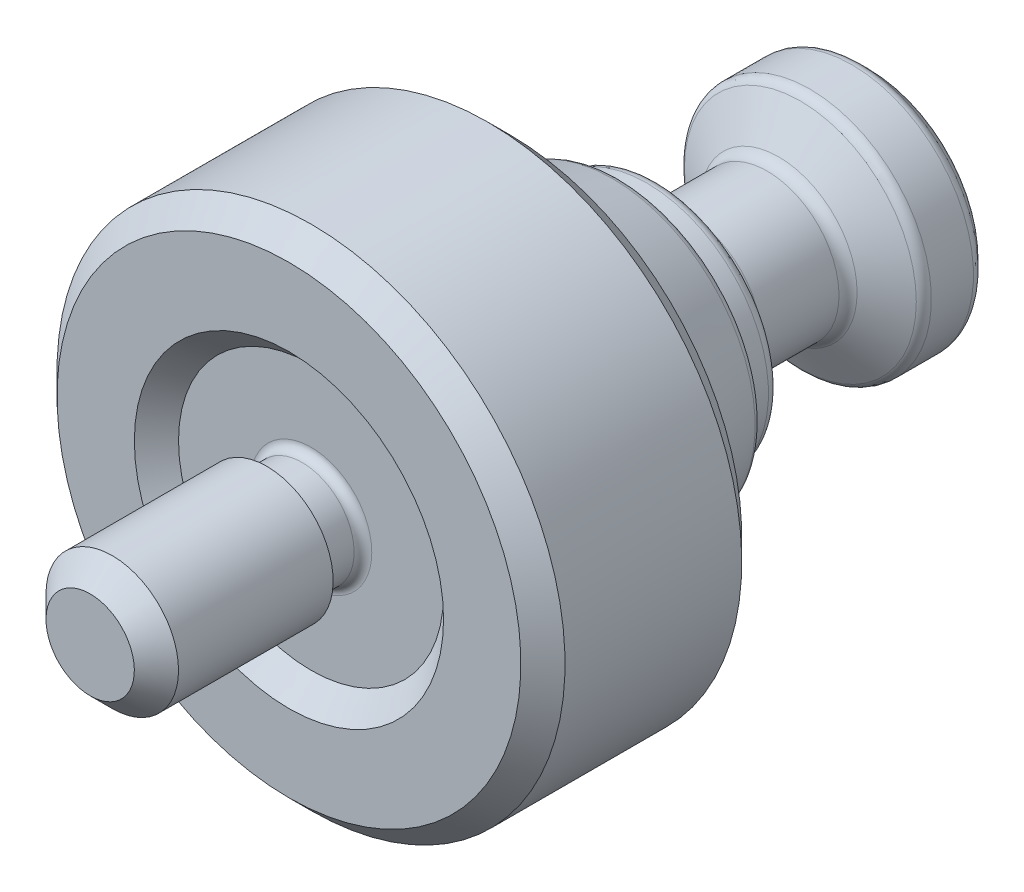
ISO-10303-21;
HEADER;
FILE_DESCRIPTION(('STEP AP214'),'2;1');
FILE_NAME('part.step','',(''),(''),'','','');
FILE_SCHEMA(('AUTOMOTIVE_DESIGN { 1 0 10303 214 1 1 1 1 }'));
ENDSEC;
DATA;
#1=APPLICATION_CONTEXT('core data for automotive mechanical design processes');
#2=APPLICATION_PROTOCOL_DEFINITION('international standard','automotive_design',2000,#1);
#3=PRODUCT_CONTEXT('',#1,'mechanical');
#4=PRODUCT('Part','Part','',(#3));
#5=PRODUCT_RELATED_PRODUCT_CATEGORY('part','',(#4));
#6=PRODUCT_DEFINITION_FORMATION('','',#4);
#7=PRODUCT_DEFINITION_CONTEXT('part definition',#1,'design');
#8=PRODUCT_DEFINITION('design','',#6,#7);
#9=PRODUCT_DEFINITION_SHAPE('','',#8);
#10=(LENGTH_UNIT() NAMED_UNIT(*) SI_UNIT(.MILLI.,.METRE.));
#11=(NAMED_UNIT(*) PLANE_ANGLE_UNIT() SI_UNIT($,.RADIAN.));
#12=(NAMED_UNIT(*) SI_UNIT($,.STERADIAN.) SOLID_ANGLE_UNIT());
#13=UNCERTAINTY_MEASURE_WITH_UNIT(LENGTH_MEASURE(1.E-05),#10,'distance_accuracy_value','');
#14=(GEOMETRIC_REPRESENTATION_CONTEXT(3) GLOBAL_UNCERTAINTY_ASSIGNED_CONTEXT((#13)) GLOBAL_UNIT_ASSIGNED_CONTEXT((#10,
#11,#12)) REPRESENTATION_CONTEXT('',''));
#15=CARTESIAN_POINT('',(0.,0.,0.));
#16=DIRECTION('',(0.,0.,1.));
#17=DIRECTION('',(1.,0.,0.));
#18=AXIS2_PLACEMENT_3D('',#15,#16,#17);
#19=CARTESIAN_POINT('',(0.,0.,9.));
#20=DIRECTION('',(0.,0.,-1.));
#21=DIRECTION('',(1.,0.,0.));
#22=AXIS2_PLACEMENT_3D('',#19,#20,#21);
#23=PLANE('',#22);
#24=CARTESIAN_POINT('',(0.,0.,9.));
#25=DIRECTION('',(0.,0.,1.));
#26=DIRECTION('',(1.,0.,0.));
#27=AXIS2_PLACEMENT_3D('',#24,#25,#26);
#28=CIRCLE('',#27,2.75);
#29=CARTESIAN_POINT('',(2.75,0.,9.));
#30=VERTEX_POINT('',#29);
#31=EDGE_CURVE('E23',#30,#30,#28,.T.);
#32=ORIENTED_EDGE('',*,*,#31,.F.);
#33=EDGE_LOOP('',(#32));
#34=FACE_BOUND('',#33,.T.);
#35=CARTESIAN_POINT('',(0.,0.,9.));
#36=DIRECTION('',(0.,0.,1.));
#37=DIRECTION('',(0.,-1.,0.));
#38=AXIS2_PLACEMENT_3D('',#35,#36,#37);
#39=CIRCLE('',#38,6.);
#40=CARTESIAN_POINT('',(0.,-6.,9.));
#41=VERTEX_POINT('',#40);
#42=EDGE_CURVE('E188',#41,#41,#39,.T.);
#43=ORIENTED_EDGE('',*,*,#42,.T.);
#44=EDGE_LOOP('',(#43));
#45=FACE_BOUND('',#44,.T.);
#46=ADVANCED_FACE('F14',(#34,#45),#23,.F.);
#47=CARTESIAN_POINT('',(0.,0.,19.));
#48=DIRECTION('',(0.,0.,1.));
#49=DIRECTION('',(0.,-1.,0.));
#50=AXIS2_PLACEMENT_3D('',#47,#48,#49);
#51=PLANE('',#50);
#52=CARTESIAN_POINT('',(0.,0.,19.));
#53=DIRECTION('',(0.,0.,1.));
#54=DIRECTION('',(0.,-1.,0.));
#55=AXIS2_PLACEMENT_3D('',#52,#53,#54);
#56=CIRCLE('',#55,2.);
#57=CARTESIAN_POINT('',(0.,-2.,19.));
#58=VERTEX_POINT('',#57);
#59=EDGE_CURVE('E119',#58,#58,#56,.T.);
#60=ORIENTED_EDGE('',*,*,#59,.T.);
#61=EDGE_LOOP('',(#60));
#62=FACE_BOUND('',#61,.T.);
#63=ADVANCED_FACE('F294',(#62),#51,.T.);
#64=CARTESIAN_POINT('',(0.,0.,18.));
#65=DIRECTION('',(0.,0.,-1.));
#66=DIRECTION('',(0.,1.,0.));
#67=AXIS2_PLACEMENT_3D('',#64,#65,#66);
#68=CONICAL_SURFACE('',#67,3.,0.78539816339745);
#69=ORIENTED_EDGE('',*,*,#59,.F.);
#70=EDGE_LOOP('',(#69));
#71=FACE_BOUND('',#70,.T.);
#72=CARTESIAN_POINT('',(0.,0.,18.));
#73=DIRECTION('',(0.,0.,1.));
#74=DIRECTION('',(0.,-1.,0.));
#75=AXIS2_PLACEMENT_3D('',#72,#73,#74);
#76=CIRCLE('',#75,3.);
#77=CARTESIAN_POINT('',(0.,-3.,18.));
#78=VERTEX_POINT('',#77);
#79=EDGE_CURVE('E116',#78,#78,#76,.F.);
#80=ORIENTED_EDGE('',*,*,#79,.F.);
#81=EDGE_LOOP('',(#80));
#82=FACE_BOUND('',#81,.T.);
#83=ADVANCED_FACE('F287',(#71,#82),#68,.T.);
#84=CARTESIAN_POINT('',(0.,0.,0.));
#85=DIRECTION('',(0.,0.,-1.));
#86=DIRECTION('',(0.,1.,0.));
#87=AXIS2_PLACEMENT_3D('',#84,#85,#86);
#88=CYLINDRICAL_SURFACE('',#87,3.);
#89=CARTESIAN_POINT('',(0.,0.,11.));
#90=DIRECTION('',(0.,0.,-1.));
#91=DIRECTION('',(0.,1.,0.));
#92=AXIS2_PLACEMENT_3D('',#89,#90,#91);
#93=CIRCLE('',#92,3.);
#94=CARTESIAN_POINT('',(0.,3.,11.));
#95=VERTEX_POINT('',#94);
#96=EDGE_CURVE('E193',#95,#95,#93,.T.);
#97=ORIENTED_EDGE('',*,*,#96,.F.);
#98=EDGE_LOOP('',(#97));
#99=FACE_BOUND('',#98,.T.);
#100=ORIENTED_EDGE('',*,*,#79,.T.);
#101=EDGE_LOOP('',(#100));
#102=FACE_BOUND('',#101,.T.);
#103=ADVANCED_FACE('F279',(#99,#102),#88,.T.);
#104=CARTESIAN_POINT('',(3.,0.,11.));
#105=DIRECTION('',(0.,0.,1.));
#106=DIRECTION('',(0.,-1.,0.));
#107=AXIS2_PLACEMENT_3D('',#104,#105,#106);
#108=PLANE('',#107);
#109=CARTESIAN_POINT('',(0.,0.,11.));
#110=DIRECTION('',(0.,0.,1.));
#111=DIRECTION('',(0.,-1.,0.));
#112=AXIS2_PLACEMENT_3D('',#109,#110,#111);
#113=CIRCLE('',#112,2.75);
#114=CARTESIAN_POINT('',(0.,-2.75,11.));
#115=VERTEX_POINT('',#114);
#116=EDGE_CURVE('E18',#115,#115,#113,.T.);
#117=ORIENTED_EDGE('',*,*,#116,.T.);
#118=EDGE_LOOP('',(#117));
#119=FACE_BOUND('',#118,.T.);
#120=ORIENTED_EDGE('',*,*,#96,.T.);
#121=EDGE_LOOP('',(#120));
#122=FACE_BOUND('',#121,.T.);
#123=ADVANCED_FACE('F276',(#119,#122),#108,.F.);
#124=CARTESIAN_POINT('',(0.,0.,10.6));
#125=DIRECTION('',(0.,0.,1.));
#126=DIRECTION('',(0.,-1.,0.));
#127=AXIS2_PLACEMENT_3D('',#124,#125,#126);
#128=TOROIDAL_SURFACE('',#127,2.75,0.4);
#129=ORIENTED_EDGE('',*,*,#116,.F.);
#130=EDGE_LOOP('',(#129));
#131=FACE_BOUND('',#130,.T.);
#132=CARTESIAN_POINT('',(0.,0.,10.6));
#133=DIRECTION('',(0.,0.,1.));
#134=DIRECTION('',(0.,-1.,0.));
#135=AXIS2_PLACEMENT_3D('',#132,#133,#134);
#136=CIRCLE('',#135,2.35);
#137=CARTESIAN_POINT('',(0.,-2.35,10.6));
#138=VERTEX_POINT('',#137);
#139=EDGE_CURVE('E163',#138,#138,#136,.F.);
#140=ORIENTED_EDGE('',*,*,#139,.F.);
#141=EDGE_LOOP('',(#140));
#142=FACE_BOUND('',#141,.T.);
#143=ADVANCED_FACE('F278',(#131,#142),#128,.F.);
#144=CARTESIAN_POINT('',(0.,0.,0.));
#145=DIRECTION('',(0.,0.,-1.));
#146=DIRECTION('',(0.,1.,0.));
#147=AXIS2_PLACEMENT_3D('',#144,#145,#146);
#148=CYLINDRICAL_SURFACE('',#147,2.35);
#149=ORIENTED_EDGE('',*,*,#139,.T.);
#150=EDGE_LOOP('',(#149));
#151=FACE_BOUND('',#150,.T.);
#152=CARTESIAN_POINT('',(0.,0.,9.4));
#153=DIRECTION('',(0.,0.,1.));
#154=DIRECTION('',(0.,-1.,0.));
#155=AXIS2_PLACEMENT_3D('',#152,#153,#154);
#156=CIRCLE('',#155,2.35);
#157=CARTESIAN_POINT('',(0.,-2.35,9.4));
#158=VERTEX_POINT('',#157);
#159=EDGE_CURVE('E161',#158,#158,#156,.T.);
#160=ORIENTED_EDGE('',*,*,#159,.T.);
#161=EDGE_LOOP('',(#160));
#162=FACE_BOUND('',#161,.T.);
#163=ADVANCED_FACE('F281',(#151,#162),#148,.T.);
#164=CARTESIAN_POINT('',(0.,0.,9.4));
#165=DIRECTION('',(0.,0.,1.));
#166=DIRECTION('',(0.,-1.,0.));
#167=AXIS2_PLACEMENT_3D('',#164,#165,#166);
#168=TOROIDAL_SURFACE('',#167,2.75,0.4);
#169=ORIENTED_EDGE('',*,*,#159,.F.);
#170=EDGE_LOOP('',(#169));
#171=FACE_BOUND('',#170,.T.);
#172=ORIENTED_EDGE('',*,*,#31,.T.);
#173=EDGE_LOOP('',(#172));
#174=FACE_BOUND('',#173,.T.);
#175=ADVANCED_FACE('F16',(#171,#174),#168,.F.);
#176=CARTESIAN_POINT('',(0.,0.,9.));
#177=DIRECTION('',(0.,0.,-1.));
#178=DIRECTION('',(0.,1.,0.));
#179=AXIS2_PLACEMENT_3D('',#176,#177,#178);
#180=CONICAL_SURFACE('',#179,11.5,0.785398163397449);
#181=CARTESIAN_POINT('',(0.,0.,10.));
#182=DIRECTION('',(0.,0.,1.));
#183=DIRECTION('',(0.,-1.,0.));
#184=AXIS2_PLACEMENT_3D('',#181,#182,#183);
#185=CIRCLE('',#184,10.5);
#186=CARTESIAN_POINT('',(0.,-10.5,10.));
#187=VERTEX_POINT('',#186);
#188=EDGE_CURVE('E177',#187,#187,#185,.T.);
#189=ORIENTED_EDGE('',*,*,#188,.F.);
#190=EDGE_LOOP('',(#189));
#191=FACE_BOUND('',#190,.T.);
#192=CARTESIAN_POINT('',(0.,0.,9.));
#193=DIRECTION('',(0.,0.,1.));
#194=DIRECTION('',(0.,-1.,0.));
#195=AXIS2_PLACEMENT_3D('',#192,#193,#194);
#196=CIRCLE('',#195,11.5);
#197=CARTESIAN_POINT('',(0.,-11.5,9.));
#198=VERTEX_POINT('',#197);
#199=EDGE_CURVE('E172',#198,#198,#196,.F.);
#200=ORIENTED_EDGE('',*,*,#199,.F.);
#201=EDGE_LOOP('',(#200));
#202=FACE_BOUND('',#201,.T.);
#203=ADVANCED_FACE('F298',(#191,#202),#180,.T.);
#204=CARTESIAN_POINT('',(6.,0.,10.));
#205=DIRECTION('',(0.,0.,1.));
#206=DIRECTION('',(0.,-1.,0.));
#207=AXIS2_PLACEMENT_3D('',#204,#205,#206);
#208=PLANE('',#207);
#209=CARTESIAN_POINT('',(0.,0.,10.));
#210=DIRECTION('',(0.,0.,1.));
#211=DIRECTION('',(0.,-1.,0.));
#212=AXIS2_PLACEMENT_3D('',#209,#210,#211);
#213=CIRCLE('',#212,7.);
#214=CARTESIAN_POINT('',(0.,-7.,10.));
#215=VERTEX_POINT('',#214);
#216=EDGE_CURVE('E185',#215,#215,#213,.F.);
#217=ORIENTED_EDGE('',*,*,#216,.T.);
#218=EDGE_LOOP('',(#217));
#219=FACE_BOUND('',#218,.T.);
#220=ORIENTED_EDGE('',*,*,#188,.T.);
#221=EDGE_LOOP('',(#220));
#222=FACE_BOUND('',#221,.T.);
#223=ADVANCED_FACE('F383',(#219,#222),#208,.T.);
#224=CARTESIAN_POINT('',(0.,0.,10.));
#225=DIRECTION('',(0.,0.,1.));
#226=DIRECTION('',(0.,-1.,0.));
#227=AXIS2_PLACEMENT_3D('',#224,#225,#226);
#228=CONICAL_SURFACE('',#227,7.,0.785398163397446);
#229=ORIENTED_EDGE('',*,*,#42,.F.);
#230=EDGE_LOOP('',(#229));
#231=FACE_BOUND('',#230,.T.);
#232=ORIENTED_EDGE('',*,*,#216,.F.);
#233=EDGE_LOOP('',(#232));
#234=FACE_BOUND('',#233,.T.);
#235=ADVANCED_FACE('F387',(#231,#234),#228,.F.);
#236=CARTESIAN_POINT('',(0.,0.,0.));
#237=DIRECTION('',(0.,0.,-1.));
#238=DIRECTION('',(0.,1.,0.));
#239=AXIS2_PLACEMENT_3D('',#236,#237,#238);
#240=CYLINDRICAL_SURFACE('',#239,11.5);
#241=ORIENTED_EDGE('',*,*,#199,.T.);
#242=EDGE_LOOP('',(#241));
#243=FACE_BOUND('',#242,.T.);
#244=CARTESIAN_POINT('',(0.,0.,1.));
#245=DIRECTION('',(0.,0.,-1.));
#246=DIRECTION('',(0.,1.,0.));
#247=AXIS2_PLACEMENT_3D('',#244,#245,#246);
#248=CIRCLE('',#247,11.5);
#249=CARTESIAN_POINT('',(0.,11.5,1.));
#250=VERTEX_POINT('',#249);
#251=EDGE_CURVE('E168',#250,#250,#248,.F.);
#252=ORIENTED_EDGE('',*,*,#251,.T.);
#253=EDGE_LOOP('',(#252));
#254=FACE_BOUND('',#253,.T.);
#255=ADVANCED_FACE('F377',(#243,#254),#240,.T.);
#256=CARTESIAN_POINT('',(0.,0.,0.));
#257=DIRECTION('',(0.,0.,1.));
#258=DIRECTION('',(0.,-1.,0.));
#259=AXIS2_PLACEMENT_3D('',#256,#257,#258);
#260=CONICAL_SURFACE('',#259,10.5,0.785398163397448);
#261=ORIENTED_EDGE('',*,*,#251,.F.);
#262=EDGE_LOOP('',(#261));
#263=FACE_BOUND('',#262,.T.);
#264=CARTESIAN_POINT('',(0.,0.,0.));
#265=DIRECTION('',(0.,0.,-1.));
#266=DIRECTION('',(0.,1.,0.));
#267=AXIS2_PLACEMENT_3D('',#264,#265,#266);
#268=CIRCLE('',#267,10.5);
#269=CARTESIAN_POINT('',(0.,10.5,0.));
#270=VERTEX_POINT('',#269);
#271=EDGE_CURVE('E182',#270,#270,#268,.T.);
#272=ORIENTED_EDGE('',*,*,#271,.F.);
#273=EDGE_LOOP('',(#272));
#274=FACE_BOUND('',#273,.T.);
#275=ADVANCED_FACE('F370',(#263,#274),#260,.T.);
#276=CARTESIAN_POINT('',(11.5,0.,0.));
#277=DIRECTION('',(0.,0.,-1.));
#278=DIRECTION('',(0.,1.,0.));
#279=AXIS2_PLACEMENT_3D('',#276,#277,#278);
#280=PLANE('',#279);
#281=ORIENTED_EDGE('',*,*,#271,.T.);
#282=EDGE_LOOP('',(#281));
#283=FACE_BOUND('',#282,.T.);
#284=CARTESIAN_POINT('',(0.,0.,0.));
#285=DIRECTION('',(0.,0.,-1.));
#286=DIRECTION('',(-1.,0.,0.));
#287=AXIS2_PLACEMENT_3D('',#284,#285,#286);
#288=CIRCLE('',#287,7.3);
#289=CARTESIAN_POINT('',(-7.3,0.,0.));
#290=VERTEX_POINT('',#289);
#291=EDGE_CURVE('E9',#290,#290,#288,.T.);
#292=ORIENTED_EDGE('',*,*,#291,.F.);
#293=EDGE_LOOP('',(#292));
#294=FACE_BOUND('',#293,.T.);
#295=ADVANCED_FACE('F360',(#283,#294),#280,.T.);
#296=CARTESIAN_POINT('',(1.73205080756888,0.,-14.));
#297=DIRECTION('',(0.,0.,-1.));
#298=DIRECTION('',(0.,1.,0.));
#299=AXIS2_PLACEMENT_3D('',#296,#297,#298);
#300=PLANE('',#299);
#301=DIRECTION('',(-0.5,0.866025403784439,0.));
#302=VECTOR('',#301,1.);
#303=CARTESIAN_POINT('',(-0.866025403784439,-1.5,-14.));
#304=LINE('',#303,#302);
#305=CARTESIAN_POINT('',(-0.866025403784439,-1.5,-14.));
#306=VERTEX_POINT('',#305);
#307=CARTESIAN_POINT('',(-1.73205080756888,0.,-14.));
#308=VERTEX_POINT('',#307);
#309=EDGE_CURVE('E690',#306,#308,#304,.T.);
#310=ORIENTED_EDGE('',*,*,#309,.T.);
#311=DIRECTION('',(0.5,0.866025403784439,0.));
#312=VECTOR('',#311,1.);
#313=CARTESIAN_POINT('',(-1.73205080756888,0.,-14.));
#314=LINE('',#313,#312);
#315=CARTESIAN_POINT('',(-0.866025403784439,1.5,-14.));
#316=VERTEX_POINT('',#315);
#317=EDGE_CURVE('E691',#308,#316,#314,.T.);
#318=ORIENTED_EDGE('',*,*,#317,.T.);
#319=DIRECTION('',(1.,0.,0.));
#320=VECTOR('',#319,1.);
#321=CARTESIAN_POINT('',(-0.866025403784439,1.5,-14.));
#322=LINE('',#321,#320);
#323=CARTESIAN_POINT('',(0.86602540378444,1.5,-14.));
#324=VERTEX_POINT('',#323);
#325=EDGE_CURVE('E39',#316,#324,#322,.T.);
#326=ORIENTED_EDGE('',*,*,#325,.T.);
#327=DIRECTION('',(0.5,-0.866025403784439,0.));
#328=VECTOR('',#327,1.);
#329=CARTESIAN_POINT('',(0.86602540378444,1.5,-14.));
#330=LINE('',#329,#328);
#331=CARTESIAN_POINT('',(1.73205080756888,0.,-14.));
#332=VERTEX_POINT('',#331);
#333=EDGE_CURVE('E87',#324,#332,#330,.T.);
#334=ORIENTED_EDGE('',*,*,#333,.T.);
#335=DIRECTION('',(-0.5,-0.866025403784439,0.));
#336=VECTOR('',#335,1.);
#337=CARTESIAN_POINT('',(1.73205080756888,0.,-14.));
#338=LINE('',#337,#336);
#339=CARTESIAN_POINT('',(0.866025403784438,-1.5,-14.));
#340=VERTEX_POINT('',#339);
#341=EDGE_CURVE('E694',#332,#340,#338,.T.);
#342=ORIENTED_EDGE('',*,*,#341,.T.);
#343=DIRECTION('',(-1.,0.,0.));
#344=VECTOR('',#343,1.);
#345=CARTESIAN_POINT('',(0.866025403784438,-1.5,-14.));
#346=LINE('',#345,#344);
#347=EDGE_CURVE('E692',#340,#306,#346,.T.);
#348=ORIENTED_EDGE('',*,*,#347,.T.);
#349=EDGE_LOOP('',(#310,#318,#326,#334,#342,#348));
#350=FACE_BOUND('',#349,.T.);
#351=ADVANCED_FACE('F261',(#350),#300,.T.);
#352=CARTESIAN_POINT('',(0.866025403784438,-1.5,-14.));
#353=DIRECTION('',(0.,-1.,0.));
#354=DIRECTION('',(1.,0.,0.));
#355=AXIS2_PLACEMENT_3D('',#352,#353,#354);
#356=PLANE('',#355);
#357=CARTESIAN_POINT('',(-2.28397410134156,-1.5,-16.9229071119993));
#358=CARTESIAN_POINT('',(-2.21878991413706,-1.5,-16.8914593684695));
#359=CARTESIAN_POINT('',(-2.1534515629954,-1.5,-16.8603257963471));
#360=CARTESIAN_POINT('',(-2.02238403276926,-1.5,-16.7988644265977));
#361=CARTESIAN_POINT('',(-1.95665478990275,-1.5,-16.7685367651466));
#362=CARTESIAN_POINT('',(-1.82436364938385,-1.5,-16.7087029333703));
#363=CARTESIAN_POINT('',(-1.75779913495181,-1.5,-16.6792025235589));
#364=CARTESIAN_POINT('',(-1.62412650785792,-1.5,-16.6214679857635));
#365=CARTESIAN_POINT('',(-1.55701842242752,-1.5,-16.5932337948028));
#366=CARTESIAN_POINT('',(-1.42017535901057,-1.5,-16.537561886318));
#367=CARTESIAN_POINT('',(-1.35042088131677,-1.5,-16.5101714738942));
#368=CARTESIAN_POINT('',(-1.21009481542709,-1.5,-16.4575777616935));
#369=CARTESIAN_POINT('',(-1.13952312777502,-1.5,-16.4323747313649));
#370=CARTESIAN_POINT('',(-0.926675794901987,-1.5,-16.3610629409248));
#371=CARTESIAN_POINT('',(-0.782896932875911,-1.5,-16.3190937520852));
#372=CARTESIAN_POINT('',(-0.564495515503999,-1.5,-16.2698234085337));
#373=CARTESIAN_POINT('',(-0.491421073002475,-1.5,-16.2556984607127));
#374=CARTESIAN_POINT('',(-0.344405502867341,-1.5,-16.2329184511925));
#375=CARTESIAN_POINT('',(-0.270464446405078,-1.5,-16.2242629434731));
#376=CARTESIAN_POINT('',(-0.123035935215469,-1.5,-16.2132228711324));
#377=CARTESIAN_POINT('',(-0.0495544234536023,-1.5,-16.2107610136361));
#378=CARTESIAN_POINT('',(0.097348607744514,-1.5,-16.212108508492));
#379=CARTESIAN_POINT('',(0.170770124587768,-1.5,-16.2159181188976));
#380=CARTESIAN_POINT('',(0.349490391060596,-1.5,-16.2324885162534));
#381=CARTESIAN_POINT('',(0.454491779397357,-1.5,-16.2484687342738));
#382=CARTESIAN_POINT('',(0.662502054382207,-1.5,-16.2903432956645));
#383=CARTESIAN_POINT('',(0.765508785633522,-1.5,-16.3162477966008));
#384=CARTESIAN_POINT('',(0.971670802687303,-1.5,-16.3758329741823));
#385=CARTESIAN_POINT('',(1.07477868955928,-1.5,-16.409673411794));
#386=CARTESIAN_POINT('',(1.27908955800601,-1.5,-16.4824928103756));
#387=CARTESIAN_POINT('',(1.38029312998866,-1.5,-16.521470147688));
#388=CARTESIAN_POINT('',(1.62283010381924,-1.5,-16.6198322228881));
#389=CARTESIAN_POINT('',(1.76343848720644,-1.5,-16.6809869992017));
#390=CARTESIAN_POINT('',(2.04270262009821,-1.5,-16.8076296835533));
#391=CARTESIAN_POINT('',(2.18135782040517,-1.5,-16.8731187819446));
#392=CARTESIAN_POINT('',(2.45744376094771,-1.5,-17.0069670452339));
#393=CARTESIAN_POINT('',(2.59487311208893,-1.5,-17.0753290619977));
#394=CARTESIAN_POINT('',(2.8687740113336,-1.5,-17.2139473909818));
#395=CARTESIAN_POINT('',(3.00524552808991,-1.5,-17.2842037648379));
#396=CARTESIAN_POINT('',(3.26576619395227,-1.5,-17.4199372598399));
#397=CARTESIAN_POINT('',(3.3898726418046,-1.5,-17.4853046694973));
#398=CARTESIAN_POINT('',(3.63764859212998,-1.5,-17.6168720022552));
#399=CARTESIAN_POINT('',(3.76131807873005,-1.5,-17.6830719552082));
#400=CARTESIAN_POINT('',(4.00801757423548,-1.5,-17.8159423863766));
#401=CARTESIAN_POINT('',(4.13104840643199,-1.5,-17.8826113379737));
#402=CARTESIAN_POINT('',(4.37683251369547,-1.5,-18.0164434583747));
#403=CARTESIAN_POINT('',(4.49958580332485,-1.5,-18.0836066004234));
#404=CARTESIAN_POINT('',(4.62223761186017,-1.5,-18.1509533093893));
#405=B_SPLINE_CURVE_WITH_KNOTS('',3,(#357,#358,#359,#360,#361,#362,#363,#364,#365,#366,#367,
#368,#369,#370,#371,#372,#373,#374,#375,#376,#377,#378,#379,#380,#381,#382,#383,#384,#385,#386,
#387,#388,#389,#390,#391,#392,#393,#394,#395,#396,#397,#398,#399,#400,#401,#402,#403,#404),
.UNSPECIFIED.,.F.,.F.,(4,2,2,2,2,2,2,2,2,2,2,2,2,2,2,2,2,2,2,2,2,2,2,4),(0.,0.217123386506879,
0.434283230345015,0.652698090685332,0.871102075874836,1.09588117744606,1.3206879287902,
1.76909391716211,1.99221104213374,2.21530997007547,2.43561063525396,2.65592036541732,
2.9738941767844,3.29219430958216,3.61755574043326,3.94281457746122,4.40267752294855,
4.86266729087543,5.32312499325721,5.78359769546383,6.2043998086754,6.62521705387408,
7.04501578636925,7.46479195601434),.UNSPECIFIED.);
#406=CARTESIAN_POINT('',(-0.866025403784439,-1.5,-16.3452994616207));
#407=VERTEX_POINT('',#406);
#408=CARTESIAN_POINT('',(0.866025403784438,-1.5,-16.3452994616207));
#409=VERTEX_POINT('',#408);
#410=EDGE_CURVE('E246',#407,#409,#405,.T.);
#411=ORIENTED_EDGE('',*,*,#410,.F.);
#412=DIRECTION('',(0.,0.,-1.));
#413=VECTOR('',#412,1.);
#414=CARTESIAN_POINT('',(-0.866025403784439,-1.5,-14.));
#415=LINE('',#414,#413);
#416=EDGE_CURVE('E100',#306,#407,#415,.T.);
#417=ORIENTED_EDGE('',*,*,#416,.F.);
#418=ORIENTED_EDGE('',*,*,#347,.F.);
#419=DIRECTION('',(0.,0.,-1.));
#420=VECTOR('',#419,1.);
#421=CARTESIAN_POINT('',(0.866025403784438,-1.5,-14.));
#422=LINE('',#421,#420);
#423=EDGE_CURVE('E103',#340,#409,#422,.T.);
#424=ORIENTED_EDGE('',*,*,#423,.T.);
#425=EDGE_LOOP('',(#411,#417,#418,#424));
#426=FACE_BOUND('',#425,.T.);
#427=ADVANCED_FACE('F257',(#426),#356,.F.);
#428=CARTESIAN_POINT('',(-0.866025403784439,-1.5,-14.));
#429=DIRECTION('',(-0.866025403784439,-0.5,0.));
#430=DIRECTION('',(0.5,-0.866025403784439,0.));
#431=AXIS2_PLACEMENT_3D('',#428,#429,#430);
#432=PLANE('',#431);
#433=CARTESIAN_POINT('',(-1.73216627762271,0.000199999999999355,-16.3453661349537));
#434=CARTESIAN_POINT('',(-1.69410775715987,-0.0657192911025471,-16.3233823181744));
#435=CARTESIAN_POINT('',(-1.65572072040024,-0.132207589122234,-16.303388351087));
#436=CARTESIAN_POINT('',(-1.5782818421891,-0.26633566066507,-16.2684875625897));
#437=CARTESIAN_POINT('',(-1.53922862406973,-0.333977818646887,-16.2535930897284));
#438=CARTESIAN_POINT('',(-1.4616062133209,-0.468423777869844,-16.2304061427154));
#439=CARTESIAN_POINT('',(-1.42304896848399,-0.535206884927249,-16.221959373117));
#440=CARTESIAN_POINT('',(-1.34575291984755,-0.669087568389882,-16.211873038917));
#441=CARTESIAN_POINT('',(-1.30701439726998,-0.73618465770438,-16.2102251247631));
#442=CARTESIAN_POINT('',(-1.23462040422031,-0.861574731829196,-16.2136410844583));
#443=CARTESIAN_POINT('',(-1.20095413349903,-0.91988642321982,-16.2178662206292));
#444=CARTESIAN_POINT('',(-1.13384094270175,-1.03612987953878,-16.2312612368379));
#445=CARTESIAN_POINT('',(-1.10039425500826,-1.09406124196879,-16.240435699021));
#446=CARTESIAN_POINT('',(-1.03314252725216,-1.21054465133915,-16.2633726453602));
#447=CARTESIAN_POINT('',(-0.999346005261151,-1.26908194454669,-16.2772324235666));
#448=CARTESIAN_POINT('',(-0.932257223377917,-1.38528312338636,-16.3086892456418));
#449=CARTESIAN_POINT('',(-0.89896410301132,-1.44294849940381,-16.3262788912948));
#450=CARTESIAN_POINT('',(-0.865909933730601,-1.5002,-16.3453661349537));
#451=B_SPLINE_CURVE_WITH_KNOTS('',3,(#433,#434,#435,#436,#437,#438,#439,#440,#441,#442,#443,
#444,#445,#446,#447,#448,#449,#450),.UNSPECIFIED.,.F.,.F.,(4,2,2,2,2,2,2,2,4),(0.,
0.237777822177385,0.476127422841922,0.708577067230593,0.940741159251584,1.14294352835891,
1.34533342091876,1.55221450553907,1.75868901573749),.UNSPECIFIED.);
#452=CARTESIAN_POINT('',(-1.73205080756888,0.,-16.3452994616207));
#453=VERTEX_POINT('',#452);
#454=EDGE_CURVE('E239',#453,#407,#451,.T.);
#455=ORIENTED_EDGE('',*,*,#454,.F.);
#456=DIRECTION('',(0.,0.,-1.));
#457=VECTOR('',#456,1.);
#458=CARTESIAN_POINT('',(-1.73205080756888,0.,-14.));
#459=LINE('',#458,#457);
#460=EDGE_CURVE('E93',#308,#453,#459,.T.);
#461=ORIENTED_EDGE('',*,*,#460,.F.);
#462=ORIENTED_EDGE('',*,*,#309,.F.);
#463=ORIENTED_EDGE('',*,*,#416,.T.);
#464=EDGE_LOOP('',(#455,#461,#462,#463));
#465=FACE_BOUND('',#464,.T.);
#466=ADVANCED_FACE('F260',(#465),#432,.F.);
#467=CARTESIAN_POINT('',(-1.73205080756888,0.,-14.));
#468=DIRECTION('',(-0.866025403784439,0.5,0.));
#469=DIRECTION('',(-0.5,-0.866025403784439,0.));
#470=AXIS2_PLACEMENT_3D('',#467,#468,#469);
#471=PLANE('',#470);
#472=CARTESIAN_POINT('',(-0.865909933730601,1.5002,-16.3453661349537));
#473=CARTESIAN_POINT('',(-0.903968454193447,1.43428070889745,-16.3233823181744));
#474=CARTESIAN_POINT('',(-0.942355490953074,1.36779241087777,-16.303388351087));
#475=CARTESIAN_POINT('',(-1.01979436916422,1.23366433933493,-16.2684875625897));
#476=CARTESIAN_POINT('',(-1.05884758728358,1.16602218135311,-16.2535930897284));
#477=CARTESIAN_POINT('',(-1.13646999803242,1.03157622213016,-16.2304061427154));
#478=CARTESIAN_POINT('',(-1.17502724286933,0.964793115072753,-16.221959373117));
#479=CARTESIAN_POINT('',(-1.25232329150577,0.83091243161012,-16.211873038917));
#480=CARTESIAN_POINT('',(-1.29106181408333,0.763815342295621,-16.2102251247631));
#481=CARTESIAN_POINT('',(-1.363455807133,0.638425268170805,-16.2136410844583));
#482=CARTESIAN_POINT('',(-1.39712207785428,0.580113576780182,-16.2178662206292));
#483=CARTESIAN_POINT('',(-1.46423526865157,0.46387012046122,-16.2312612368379));
#484=CARTESIAN_POINT('',(-1.49768195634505,0.405938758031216,-16.240435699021));
#485=CARTESIAN_POINT('',(-1.56493368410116,0.289455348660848,-16.2633726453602));
#486=CARTESIAN_POINT('',(-1.59873020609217,0.230918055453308,-16.2772324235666));
#487=CARTESIAN_POINT('',(-1.6658189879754,0.114716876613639,-16.3086892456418));
#488=CARTESIAN_POINT('',(-1.699112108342,0.0570515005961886,-16.3262788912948));
#489=CARTESIAN_POINT('',(-1.73216627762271,-0.000200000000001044,-16.3453661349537));
#490=B_SPLINE_CURVE_WITH_KNOTS('',3,(#472,#473,#474,#475,#476,#477,#478,#479,#480,#481,#482,
#483,#484,#485,#486,#487,#488,#489),.UNSPECIFIED.,.F.,.F.,(4,2,2,2,2,2,2,2,4),(0.,
0.237777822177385,0.476127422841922,0.708577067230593,0.940741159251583,1.14294352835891,
1.34533342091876,1.55221450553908,1.75868901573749),.UNSPECIFIED.);
#491=CARTESIAN_POINT('',(-0.866025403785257,1.5,-16.3452994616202));
#492=VERTEX_POINT('',#491);
#493=EDGE_CURVE('E84',#492,#453,#490,.T.);
#494=ORIENTED_EDGE('',*,*,#493,.F.);
#495=DIRECTION('',(0.,0.,-1.));
#496=VECTOR('',#495,1.);
#497=CARTESIAN_POINT('',(-0.866025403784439,1.5,-14.));
#498=LINE('',#497,#496);
#499=EDGE_CURVE('E83',#316,#492,#498,.T.);
#500=ORIENTED_EDGE('',*,*,#499,.F.);
#501=ORIENTED_EDGE('',*,*,#317,.F.);
#502=ORIENTED_EDGE('',*,*,#460,.T.);
#503=EDGE_LOOP('',(#494,#500,#501,#502));
#504=FACE_BOUND('',#503,.T.);
#505=ADVANCED_FACE('F572',(#504),#471,.F.);
#506=CARTESIAN_POINT('',(-0.866025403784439,1.5,-14.));
#507=DIRECTION('',(0.,1.,0.));
#508=DIRECTION('',(-1.,0.,0.));
#509=AXIS2_PLACEMENT_3D('',#506,#507,#508);
#510=PLANE('',#509);
#511=CARTESIAN_POINT('',(-2.28397410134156,1.5,-16.9229071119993));
#512=CARTESIAN_POINT('',(-2.21878991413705,1.5,-16.8914593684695));
#513=CARTESIAN_POINT('',(-2.1534515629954,1.5,-16.8603257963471));
#514=CARTESIAN_POINT('',(-2.02238403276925,1.5,-16.7988644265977));
#515=CARTESIAN_POINT('',(-1.95665478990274,1.5,-16.7685367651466));
#516=CARTESIAN_POINT('',(-1.82436364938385,1.5,-16.7087029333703));
#517=CARTESIAN_POINT('',(-1.75779913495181,1.5,-16.6792025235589));
#518=CARTESIAN_POINT('',(-1.62412650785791,1.5,-16.6214679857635));
#519=CARTESIAN_POINT('',(-1.55701842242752,1.5,-16.5932337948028));
#520=CARTESIAN_POINT('',(-1.42017535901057,1.5,-16.537561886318));
#521=CARTESIAN_POINT('',(-1.35042088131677,1.5,-16.5101714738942));
#522=CARTESIAN_POINT('',(-1.21009481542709,1.5,-16.4575777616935));
#523=CARTESIAN_POINT('',(-1.13952312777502,1.5,-16.4323747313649));
#524=CARTESIAN_POINT('',(-0.926675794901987,1.5,-16.3610629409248));
#525=CARTESIAN_POINT('',(-0.782896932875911,1.5,-16.3190937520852));
#526=CARTESIAN_POINT('',(-0.564495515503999,1.5,-16.2698234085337));
#527=CARTESIAN_POINT('',(-0.491421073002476,1.5,-16.2556984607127));
#528=CARTESIAN_POINT('',(-0.344405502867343,1.5,-16.2329184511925));
#529=CARTESIAN_POINT('',(-0.27046444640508,1.5,-16.2242629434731));
#530=CARTESIAN_POINT('',(-0.123035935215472,1.5,-16.2132228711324));
#531=CARTESIAN_POINT('',(-0.0495544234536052,1.5,-16.2107610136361));
#532=CARTESIAN_POINT('',(0.0973486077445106,1.5,-16.212108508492));
#533=CARTESIAN_POINT('',(0.170770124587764,1.5,-16.2159181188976));
#534=CARTESIAN_POINT('',(0.349490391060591,1.5,-16.2324885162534));
#535=CARTESIAN_POINT('',(0.454491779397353,1.5,-16.2484687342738));
#536=CARTESIAN_POINT('',(0.662502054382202,1.5,-16.2903432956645));
#537=CARTESIAN_POINT('',(0.765508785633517,1.5,-16.3162477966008));
#538=CARTESIAN_POINT('',(0.971670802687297,1.5,-16.3758329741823));
#539=CARTESIAN_POINT('',(1.07477868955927,1.5,-16.409673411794));
#540=CARTESIAN_POINT('',(1.279089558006,1.5,-16.4824928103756));
#541=CARTESIAN_POINT('',(1.38029312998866,1.5,-16.521470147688));
#542=CARTESIAN_POINT('',(1.62283010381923,1.5,-16.6198322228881));
#543=CARTESIAN_POINT('',(1.76343848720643,1.5,-16.6809869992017));
#544=CARTESIAN_POINT('',(2.0427026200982,1.5,-16.8076296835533));
#545=CARTESIAN_POINT('',(2.18135782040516,1.5,-16.8731187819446));
#546=CARTESIAN_POINT('',(2.4574437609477,1.5,-17.0069670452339));
#547=CARTESIAN_POINT('',(2.59487311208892,1.5,-17.0753290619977));
#548=CARTESIAN_POINT('',(2.86877401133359,1.5,-17.2139473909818));
#549=CARTESIAN_POINT('',(3.0052455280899,1.5,-17.2842037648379));
#550=CARTESIAN_POINT('',(3.26576619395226,1.5,-17.4199372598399));
#551=CARTESIAN_POINT('',(3.38987264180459,1.5,-17.4853046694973));
#552=CARTESIAN_POINT('',(3.63764859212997,1.5,-17.6168720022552));
#553=CARTESIAN_POINT('',(3.76131807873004,1.5,-17.6830719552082));
#554=CARTESIAN_POINT('',(4.00801757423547,1.5,-17.8159423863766));
#555=CARTESIAN_POINT('',(4.13104840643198,1.5,-17.8826113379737));
#556=CARTESIAN_POINT('',(4.37683251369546,1.5,-18.0164434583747));
#557=CARTESIAN_POINT('',(4.49958580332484,1.5,-18.0836066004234));
#558=CARTESIAN_POINT('',(4.62223761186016,1.5,-18.1509533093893));
#559=B_SPLINE_CURVE_WITH_KNOTS('',3,(#511,#512,#513,#514,#515,#516,#517,#518,#519,#520,#521,
#522,#523,#524,#525,#526,#527,#528,#529,#530,#531,#532,#533,#534,#535,#536,#537,#538,#539,#540,
#541,#542,#543,#544,#545,#546,#547,#548,#549,#550,#551,#552,#553,#554,#555,#556,#557,#558),
.UNSPECIFIED.,.F.,.F.,(4,2,2,2,2,2,2,2,2,2,2,2,2,2,2,2,2,2,2,2,2,2,2,4),(0.,0.217123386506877,
0.434283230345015,0.65269809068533,0.871102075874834,1.09588117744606,1.3206879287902,
1.7690939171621,1.99221104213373,2.21530997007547,2.43561063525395,2.65592036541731,
2.9738941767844,3.29219430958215,3.61755574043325,3.94281457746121,4.40267752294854,
4.86266729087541,5.3231249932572,5.78359769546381,6.20439980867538,6.62521705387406,
7.04501578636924,7.46479195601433),.UNSPECIFIED.);
#560=CARTESIAN_POINT('',(0.86602540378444,1.5,-16.3452994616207));
#561=VERTEX_POINT('',#560);
#562=EDGE_CURVE('E69',#561,#492,#559,.F.);
#563=ORIENTED_EDGE('',*,*,#562,.F.);
#564=DIRECTION('',(0.,0.,-1.));
#565=VECTOR('',#564,1.);
#566=CARTESIAN_POINT('',(0.86602540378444,1.5,-14.));
#567=LINE('',#566,#565);
#568=EDGE_CURVE('E80',#324,#561,#567,.T.);
#569=ORIENTED_EDGE('',*,*,#568,.F.);
#570=ORIENTED_EDGE('',*,*,#325,.F.);
#571=ORIENTED_EDGE('',*,*,#499,.T.);
#572=EDGE_LOOP('',(#563,#569,#570,#571));
#573=FACE_BOUND('',#572,.T.);
#574=ADVANCED_FACE('F79',(#573),#510,.F.);
#575=CARTESIAN_POINT('',(0.86602540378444,1.5,-14.));
#576=DIRECTION('',(0.866025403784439,0.5,0.));
#577=DIRECTION('',(-0.5,0.866025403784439,0.));
#578=AXIS2_PLACEMENT_3D('',#575,#576,#577);
#579=PLANE('',#578);
#580=CARTESIAN_POINT('',(1.73216627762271,-0.000199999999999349,-16.3453661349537));
#581=CARTESIAN_POINT('',(1.69410775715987,0.0657192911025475,-16.3233823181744));
#582=CARTESIAN_POINT('',(1.65572072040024,0.132207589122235,-16.303388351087));
#583=CARTESIAN_POINT('',(1.5782818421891,0.266335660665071,-16.2684875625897));
#584=CARTESIAN_POINT('',(1.53922862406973,0.333977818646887,-16.2535930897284));
#585=CARTESIAN_POINT('',(1.4616062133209,0.468423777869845,-16.2304061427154));
#586=CARTESIAN_POINT('',(1.42304896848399,0.53520688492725,-16.221959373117));
#587=CARTESIAN_POINT('',(1.34575291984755,0.669087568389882,-16.211873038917));
#588=CARTESIAN_POINT('',(1.30701439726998,0.73618465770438,-16.2102251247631));
#589=CARTESIAN_POINT('',(1.23462040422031,0.861574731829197,-16.2136410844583));
#590=CARTESIAN_POINT('',(1.20095413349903,0.91988642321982,-16.2178662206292));
#591=CARTESIAN_POINT('',(1.13384094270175,1.03612987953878,-16.2312612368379));
#592=CARTESIAN_POINT('',(1.10039425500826,1.09406124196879,-16.240435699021));
#593=CARTESIAN_POINT('',(1.03314252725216,1.21054465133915,-16.2633726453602));
#594=CARTESIAN_POINT('',(0.999346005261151,1.26908194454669,-16.2772324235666));
#595=CARTESIAN_POINT('',(0.932257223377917,1.38528312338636,-16.3086892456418));
#596=CARTESIAN_POINT('',(0.898964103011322,1.44294849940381,-16.3262788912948));
#597=CARTESIAN_POINT('',(0.865909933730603,1.5002,-16.3453661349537));
#598=B_SPLINE_CURVE_WITH_KNOTS('',3,(#580,#581,#582,#583,#584,#585,#586,#587,#588,#589,#590,
#591,#592,#593,#594,#595,#596,#597),.UNSPECIFIED.,.F.,.F.,(4,2,2,2,2,2,2,2,4),(0.,
0.237777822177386,0.476127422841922,0.708577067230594,0.940741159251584,1.14294352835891,
1.34533342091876,1.55221450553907,1.75868901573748),.UNSPECIFIED.);
#599=CARTESIAN_POINT('',(1.73205080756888,0.,-16.3452994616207));
#600=VERTEX_POINT('',#599);
#601=EDGE_CURVE('E66',#600,#561,#598,.T.);
#602=ORIENTED_EDGE('',*,*,#601,.F.);
#603=DIRECTION('',(0.,0.,-1.));
#604=VECTOR('',#603,1.);
#605=CARTESIAN_POINT('',(1.73205080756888,0.,-14.));
#606=LINE('',#605,#604);
#607=EDGE_CURVE('E106',#332,#600,#606,.T.);
#608=ORIENTED_EDGE('',*,*,#607,.F.);
#609=ORIENTED_EDGE('',*,*,#333,.F.);
#610=ORIENTED_EDGE('',*,*,#568,.T.);
#611=EDGE_LOOP('',(#602,#608,#609,#610));
#612=FACE_BOUND('',#611,.T.);
#613=ADVANCED_FACE('F86',(#612),#579,.F.);
#614=CARTESIAN_POINT('',(1.73205080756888,0.,-14.));
#615=DIRECTION('',(0.866025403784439,-0.5,0.));
#616=DIRECTION('',(0.5,0.866025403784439,0.));
#617=AXIS2_PLACEMENT_3D('',#614,#615,#616);
#618=PLANE('',#617);
#619=CARTESIAN_POINT('',(0.8659099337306,-1.5002,-16.3453661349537));
#620=CARTESIAN_POINT('',(0.903968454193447,-1.43428070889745,-16.3233823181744));
#621=CARTESIAN_POINT('',(0.942355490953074,-1.36779241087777,-16.303388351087));
#622=CARTESIAN_POINT('',(1.01979436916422,-1.23366433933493,-16.2684875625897));
#623=CARTESIAN_POINT('',(1.05884758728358,-1.16602218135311,-16.2535930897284));
#624=CARTESIAN_POINT('',(1.13646999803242,-1.03157622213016,-16.2304061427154));
#625=CARTESIAN_POINT('',(1.17502724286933,-0.964793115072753,-16.221959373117));
#626=CARTESIAN_POINT('',(1.25232329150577,-0.830912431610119,-16.211873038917));
#627=CARTESIAN_POINT('',(1.29106181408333,-0.763815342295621,-16.2102251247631));
#628=CARTESIAN_POINT('',(1.363455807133,-0.638425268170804,-16.2136410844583));
#629=CARTESIAN_POINT('',(1.39712207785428,-0.580113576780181,-16.2178662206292));
#630=CARTESIAN_POINT('',(1.46423526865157,-0.463870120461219,-16.2312612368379));
#631=CARTESIAN_POINT('',(1.49768195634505,-0.405938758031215,-16.240435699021));
#632=CARTESIAN_POINT('',(1.56493368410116,-0.289455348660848,-16.2633726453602));
#633=CARTESIAN_POINT('',(1.59873020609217,-0.230918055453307,-16.2772324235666));
#634=CARTESIAN_POINT('',(1.6658189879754,-0.114716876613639,-16.3086892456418));
#635=CARTESIAN_POINT('',(1.699112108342,-0.0570515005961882,-16.3262788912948));
#636=CARTESIAN_POINT('',(1.73216627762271,0.000200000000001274,-16.3453661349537));
#637=B_SPLINE_CURVE_WITH_KNOTS('',3,(#619,#620,#621,#622,#623,#624,#625,#626,#627,#628,#629,
#630,#631,#632,#633,#634,#635,#636),.UNSPECIFIED.,.F.,.F.,(4,2,2,2,2,2,2,2,4),(0.,
0.237777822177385,0.476127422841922,0.708577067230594,0.940741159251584,1.14294352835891,
1.34533342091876,1.55221450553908,1.75868901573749),.UNSPECIFIED.);
#638=EDGE_CURVE('E31',#409,#600,#637,.T.);
#639=ORIENTED_EDGE('',*,*,#638,.F.);
#640=ORIENTED_EDGE('',*,*,#423,.F.);
#641=ORIENTED_EDGE('',*,*,#341,.F.);
#642=ORIENTED_EDGE('',*,*,#607,.T.);
#643=EDGE_LOOP('',(#639,#640,#641,#642));
#644=FACE_BOUND('',#643,.T.);
#645=ADVANCED_FACE('F220',(#644),#618,.F.);
#646=CARTESIAN_POINT('',(0.,0.,-16.5));
#647=DIRECTION('',(0.,0.,-1.));
#648=DIRECTION('',(0.,1.,0.));
#649=AXIS2_PLACEMENT_3D('',#646,#647,#648);
#650=CONICAL_SURFACE('',#649,2.,1.0471975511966);
#651=CARTESIAN_POINT('',(0.,0.,-16.5));
#652=DIRECTION('',(0.,0.,1.));
#653=DIRECTION('',(0.,-1.,0.));
#654=AXIS2_PLACEMENT_3D('',#651,#652,#653);
#655=CIRCLE('',#654,2.);
#656=CARTESIAN_POINT('',(0.,-2.,-16.5));
#657=VERTEX_POINT('',#656);
#658=EDGE_CURVE('E75',#657,#657,#655,.T.);
#659=ORIENTED_EDGE('',*,*,#658,.F.);
#660=EDGE_LOOP('',(#659));
#661=FACE_BOUND('',#660,.T.);
#662=ORIENTED_EDGE('',*,*,#638,.T.);
#663=ORIENTED_EDGE('',*,*,#601,.T.);
#664=ORIENTED_EDGE('',*,*,#562,.T.);
#665=ORIENTED_EDGE('',*,*,#493,.T.);
#666=ORIENTED_EDGE('',*,*,#454,.T.);
#667=ORIENTED_EDGE('',*,*,#410,.T.);
#668=EDGE_LOOP('',(#662,#663,#664,#665,#666,#667));
#669=FACE_BOUND('',#668,.T.);
#670=ADVANCED_FACE('F68',(#661,#669),#650,.F.);
#671=CARTESIAN_POINT('',(5.5,0.,-16.5));
#672=DIRECTION('',(0.,0.,-1.));
#673=DIRECTION('',(0.,1.,0.));
#674=AXIS2_PLACEMENT_3D('',#671,#672,#673);
#675=PLANE('',#674);
#676=CARTESIAN_POINT('',(0.,0.,-16.5));
#677=DIRECTION('',(0.,0.,-1.));
#678=DIRECTION('',(0.,1.,0.));
#679=AXIS2_PLACEMENT_3D('',#676,#677,#678);
#680=CIRCLE('',#679,4.28578643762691);
#681=CARTESIAN_POINT('',(0.,4.28578643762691,-16.5));
#682=VERTEX_POINT('',#681);
#683=EDGE_CURVE('E125',#682,#682,#680,.T.);
#684=ORIENTED_EDGE('',*,*,#683,.T.);
#685=EDGE_LOOP('',(#684));
#686=FACE_BOUND('',#685,.T.);
#687=ORIENTED_EDGE('',*,*,#658,.T.);
#688=EDGE_LOOP('',(#687));
#689=FACE_BOUND('',#688,.T.);
#690=ADVANCED_FACE('F219',(#686,#689),#675,.T.);
#691=CARTESIAN_POINT('',(0.,0.,-15.5));
#692=DIRECTION('',(0.,0.,-1.));
#693=DIRECTION('',(0.,1.,0.));
#694=AXIS2_PLACEMENT_3D('',#691,#692,#693);
#695=TOROIDAL_SURFACE('',#694,4.28578643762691,1.);
#696=ORIENTED_EDGE('',*,*,#683,.F.);
#697=EDGE_LOOP('',(#696));
#698=FACE_BOUND('',#697,.T.);
#699=CARTESIAN_POINT('',(0.,0.,-16.2071067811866));
#700=DIRECTION('',(0.,0.,-1.));
#701=DIRECTION('',(0.,1.,0.));
#702=AXIS2_PLACEMENT_3D('',#699,#700,#701);
#703=CIRCLE('',#702,4.99289321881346);
#704=CARTESIAN_POINT('',(0.,4.99289321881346,-16.2071067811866));
#705=VERTEX_POINT('',#704);
#706=EDGE_CURVE('E122',#705,#705,#703,.F.);
#707=ORIENTED_EDGE('',*,*,#706,.F.);
#708=EDGE_LOOP('',(#707));
#709=FACE_BOUND('',#708,.T.);
#710=ADVANCED_FACE('F222',(#698,#709),#695,.T.);
#711=CARTESIAN_POINT('',(0.,0.,-15.7));
#712=DIRECTION('',(0.,0.,1.));
#713=DIRECTION('',(0.,-1.,0.));
#714=AXIS2_PLACEMENT_3D('',#711,#712,#713);
#715=CONICAL_SURFACE('',#714,5.5,0.785398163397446);
#716=CARTESIAN_POINT('',(0.,0.,-15.8464466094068));
#717=DIRECTION('',(0.,0.,-1.));
#718=DIRECTION('',(0.,1.,0.));
#719=AXIS2_PLACEMENT_3D('',#716,#717,#718);
#720=CIRCLE('',#719,5.35355339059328);
#721=CARTESIAN_POINT('',(0.,5.35355339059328,-15.8464466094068));
#722=VERTEX_POINT('',#721);
#723=EDGE_CURVE('E137',#722,#722,#720,.T.);
#724=ORIENTED_EDGE('',*,*,#723,.T.);
#725=EDGE_LOOP('',(#724));
#726=FACE_BOUND('',#725,.T.);
#727=ORIENTED_EDGE('',*,*,#706,.T.);
#728=EDGE_LOOP('',(#727));
#729=FACE_BOUND('',#728,.T.);
#730=ADVANCED_FACE('F225',(#726,#729),#715,.T.);
#731=CARTESIAN_POINT('',(0.,0.,-15.4928932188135));
#732=DIRECTION('',(0.,0.,-1.));
#733=DIRECTION('',(0.,1.,0.));
#734=AXIS2_PLACEMENT_3D('',#731,#732,#733);
#735=TOROIDAL_SURFACE('',#734,5.,0.5);
#736=ORIENTED_EDGE('',*,*,#723,.F.);
#737=EDGE_LOOP('',(#736));
#738=FACE_BOUND('',#737,.T.);
#739=CARTESIAN_POINT('',(0.,0.,-15.4928932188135));
#740=DIRECTION('',(0.,0.,-1.));
#741=DIRECTION('',(0.,1.,0.));
#742=AXIS2_PLACEMENT_3D('',#739,#740,#741);
#743=CIRCLE('',#742,5.5);
#744=CARTESIAN_POINT('',(0.,5.5,-15.4928932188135));
#745=VERTEX_POINT('',#744);
#746=EDGE_CURVE('E134',#745,#745,#743,.F.);
#747=ORIENTED_EDGE('',*,*,#746,.F.);
#748=EDGE_LOOP('',(#747));
#749=FACE_BOUND('',#748,.T.);
#750=ADVANCED_FACE('F323',(#738,#749),#735,.T.);
#751=CARTESIAN_POINT('',(0.,0.,0.));
#752=DIRECTION('',(0.,0.,-1.));
#753=DIRECTION('',(0.,1.,0.));
#754=AXIS2_PLACEMENT_3D('',#751,#752,#753);
#755=CYLINDRICAL_SURFACE('',#754,5.5);
#756=ORIENTED_EDGE('',*,*,#746,.T.);
#757=EDGE_LOOP('',(#756));
#758=FACE_BOUND('',#757,.T.);
#759=CARTESIAN_POINT('',(0.,0.,-13.5877132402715));
#760=DIRECTION('',(0.,0.,-1.));
#761=DIRECTION('',(0.,1.,0.));
#762=AXIS2_PLACEMENT_3D('',#759,#760,#761);
#763=CIRCLE('',#762,5.5);
#764=CARTESIAN_POINT('',(0.,5.5,-13.5877132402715));
#765=VERTEX_POINT('',#764);
#766=EDGE_CURVE('E131',#765,#765,#763,.T.);
#767=ORIENTED_EDGE('',*,*,#766,.T.);
#768=EDGE_LOOP('',(#767));
#769=FACE_BOUND('',#768,.T.);
#770=ADVANCED_FACE('F320',(#758,#769),#755,.T.);
#771=CARTESIAN_POINT('',(0.,0.,-13.5877132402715));
#772=DIRECTION('',(0.,0.,-1.));
#773=DIRECTION('',(0.,1.,0.));
#774=AXIS2_PLACEMENT_3D('',#771,#772,#773);
#775=TOROIDAL_SURFACE('',#774,5.,0.5);
#776=ORIENTED_EDGE('',*,*,#766,.F.);
#777=EDGE_LOOP('',(#776));
#778=FACE_BOUND('',#777,.T.);
#779=CARTESIAN_POINT('',(0.,0.,-13.1547005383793));
#780=DIRECTION('',(0.,0.,1.));
#781=DIRECTION('',(0.,-1.,0.));
#782=AXIS2_PLACEMENT_3D('',#779,#780,#781);
#783=CIRCLE('',#782,5.25);
#784=CARTESIAN_POINT('',(0.,-5.25,-13.1547005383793));
#785=VERTEX_POINT('',#784);
#786=EDGE_CURVE('E140',#785,#785,#783,.T.);
#787=ORIENTED_EDGE('',*,*,#786,.F.);
#788=EDGE_LOOP('',(#787));
#789=FACE_BOUND('',#788,.T.);
#790=ADVANCED_FACE('F322',(#778,#789),#775,.T.);
#791=CARTESIAN_POINT('',(0.,0.,-12.));
#792=DIRECTION('',(0.,0.,-1.));
#793=DIRECTION('',(0.,1.,0.));
#794=AXIS2_PLACEMENT_3D('',#791,#792,#793);
#795=CONICAL_SURFACE('',#794,3.25,1.0471975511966);
#796=ORIENTED_EDGE('',*,*,#786,.T.);
#797=EDGE_LOOP('',(#796));
#798=FACE_BOUND('',#797,.T.);
#799=CARTESIAN_POINT('',(0.,0.,-12.1732050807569));
#800=DIRECTION('',(0.,0.,-1.));
#801=DIRECTION('',(0.,1.,0.));
#802=AXIS2_PLACEMENT_3D('',#799,#800,#801);
#803=CIRCLE('',#802,3.55);
#804=CARTESIAN_POINT('',(0.,3.55,-12.1732050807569));
#805=VERTEX_POINT('',#804);
#806=EDGE_CURVE('E110',#805,#805,#803,.T.);
#807=ORIENTED_EDGE('',*,*,#806,.T.);
#808=EDGE_LOOP('',(#807));
#809=FACE_BOUND('',#808,.T.);
#810=ADVANCED_FACE('F330',(#798,#809),#795,.T.);
#811=CARTESIAN_POINT('',(0.,0.,-11.6535898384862));
#812=DIRECTION('',(0.,0.,1.));
#813=DIRECTION('',(0.,-1.,0.));
#814=AXIS2_PLACEMENT_3D('',#811,#812,#813);
#815=TOROIDAL_SURFACE('',#814,3.85,0.6);
#816=ORIENTED_EDGE('',*,*,#806,.F.);
#817=EDGE_LOOP('',(#816));
#818=FACE_BOUND('',#817,.T.);
#819=CARTESIAN_POINT('',(0.,0.,-11.6535898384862));
#820=DIRECTION('',(0.,0.,1.));
#821=DIRECTION('',(0.,-1.,0.));
#822=AXIS2_PLACEMENT_3D('',#819,#820,#821);
#823=CIRCLE('',#822,3.25);
#824=CARTESIAN_POINT('',(0.,-3.25,-11.6535898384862));
#825=VERTEX_POINT('',#824);
#826=EDGE_CURVE('E91',#825,#825,#823,.T.);
#827=ORIENTED_EDGE('',*,*,#826,.F.);
#828=EDGE_LOOP('',(#827));
#829=FACE_BOUND('',#828,.T.);
#830=ADVANCED_FACE('F327',(#818,#829),#815,.F.);
#831=CARTESIAN_POINT('',(0.,0.,0.));
#832=DIRECTION('',(0.,0.,1.));
#833=DIRECTION('',(0.,-1.,0.));
#834=AXIS2_PLACEMENT_3D('',#831,#832,#833);
#835=CYLINDRICAL_SURFACE('',#834,3.25);
#836=ORIENTED_EDGE('',*,*,#826,.T.);
#837=EDGE_LOOP('',(#836));
#838=FACE_BOUND('',#837,.T.);
#839=CARTESIAN_POINT('',(0.,0.,-8.14544826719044));
#840=DIRECTION('',(0.,0.,1.));
#841=DIRECTION('',(0.,-1.,0.));
#842=AXIS2_PLACEMENT_3D('',#839,#840,#841);
#843=CIRCLE('',#842,3.25);
#844=CARTESIAN_POINT('',(0.,-3.25,-8.14544826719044));
#845=VERTEX_POINT('',#844);
#846=EDGE_CURVE('E88',#845,#845,#843,.F.);
#847=ORIENTED_EDGE('',*,*,#846,.T.);
#848=EDGE_LOOP('',(#847));
#849=FACE_BOUND('',#848,.T.);
#850=ADVANCED_FACE('F315',(#838,#849),#835,.T.);
#851=CARTESIAN_POINT('',(0.,0.,-8.14544826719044));
#852=DIRECTION('',(0.,0.,1.));
#853=DIRECTION('',(0.,-1.,0.));
#854=AXIS2_PLACEMENT_3D('',#851,#852,#853);
#855=TOROIDAL_SURFACE('',#854,3.85,0.6);
#856=ORIENTED_EDGE('',*,*,#846,.F.);
#857=EDGE_LOOP('',(#856));
#858=FACE_BOUND('',#857,.T.);
#859=CARTESIAN_POINT('',(0.,0.,-7.62583302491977));
#860=DIRECTION('',(0.,0.,1.));
#861=DIRECTION('',(0.,-1.,0.));
#862=AXIS2_PLACEMENT_3D('',#859,#860,#861);
#863=CIRCLE('',#862,3.55);
#864=CARTESIAN_POINT('',(0.,-3.55,-7.62583302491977));
#865=VERTEX_POINT('',#864);
#866=EDGE_CURVE('E113',#865,#865,#863,.T.);
#867=ORIENTED_EDGE('',*,*,#866,.F.);
#868=EDGE_LOOP('',(#867));
#869=FACE_BOUND('',#868,.T.);
#870=ADVANCED_FACE('F332',(#858,#869),#855,.F.);
#871=CARTESIAN_POINT('',(0.,0.,-6.5));
#872=DIRECTION('',(0.,0.,1.));
#873=DIRECTION('',(0.,-1.,0.));
#874=AXIS2_PLACEMENT_3D('',#871,#872,#873);
#875=CONICAL_SURFACE('',#874,5.5,1.0471975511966);
#876=CARTESIAN_POINT('',(0.,0.,-6.64433756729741));
#877=DIRECTION('',(0.,0.,-1.));
#878=DIRECTION('',(0.,1.,0.));
#879=AXIS2_PLACEMENT_3D('',#876,#877,#878);
#880=CIRCLE('',#879,5.25);
#881=CARTESIAN_POINT('',(0.,5.25,-6.64433756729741));
#882=VERTEX_POINT('',#881);
#883=EDGE_CURVE('E146',#882,#882,#880,.T.);
#884=ORIENTED_EDGE('',*,*,#883,.T.);
#885=EDGE_LOOP('',(#884));
#886=FACE_BOUND('',#885,.T.);
#887=ORIENTED_EDGE('',*,*,#866,.T.);
#888=EDGE_LOOP('',(#887));
#889=FACE_BOUND('',#888,.T.);
#890=ADVANCED_FACE('F334',(#886,#889),#875,.T.);
#891=CARTESIAN_POINT('',(0.,0.,-6.21132486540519));
#892=DIRECTION('',(0.,0.,-1.));
#893=DIRECTION('',(0.,1.,0.));
#894=AXIS2_PLACEMENT_3D('',#891,#892,#893);
#895=TOROIDAL_SURFACE('',#894,5.,0.5);
#896=ORIENTED_EDGE('',*,*,#883,.F.);
#897=EDGE_LOOP('',(#896));
#898=FACE_BOUND('',#897,.T.);
#899=CARTESIAN_POINT('',(0.,0.,-6.21132486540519));
#900=DIRECTION('',(0.,0.,-1.));
#901=DIRECTION('',(0.,1.,0.));
#902=AXIS2_PLACEMENT_3D('',#899,#900,#901);
#903=CIRCLE('',#902,5.5);
#904=CARTESIAN_POINT('',(0.,5.5,-6.21132486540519));
#905=VERTEX_POINT('',#904);
#906=EDGE_CURVE('E143',#905,#905,#903,.F.);
#907=ORIENTED_EDGE('',*,*,#906,.F.);
#908=EDGE_LOOP('',(#907));
#909=FACE_BOUND('',#908,.T.);
#910=ADVANCED_FACE('F349',(#898,#909),#895,.T.);
#911=CARTESIAN_POINT('',(0.,0.,-5.4));
#912=DIRECTION('',(0.,0.,-1.));
#913=DIRECTION('',(0.,1.,0.));
#914=AXIS2_PLACEMENT_3D('',#911,#912,#913);
#915=CIRCLE('',#914,5.5);
#916=CARTESIAN_POINT('',(0.,5.5,-5.4));
#917=VERTEX_POINT('',#916);
#918=EDGE_CURVE('E158',#917,#917,#915,.T.);
#919=ORIENTED_EDGE('',*,*,#918,.T.);
#920=EDGE_LOOP('',(#919));
#921=FACE_BOUND('',#920,.T.);
#922=ORIENTED_EDGE('',*,*,#906,.T.);
#923=EDGE_LOOP('',(#922));
#924=FACE_BOUND('',#923,.T.);
#925=ADVANCED_FACE('F325',(#921,#924),#755,.T.);
#926=CARTESIAN_POINT('',(0.,0.,-5.4));
#927=DIRECTION('',(0.,0.,-1.));
#928=DIRECTION('',(0.,1.,0.));
#929=AXIS2_PLACEMENT_3D('',#926,#927,#928);
#930=TOROIDAL_SURFACE('',#929,5.9,0.4);
#931=ORIENTED_EDGE('',*,*,#918,.F.);
#932=EDGE_LOOP('',(#931));
#933=FACE_BOUND('',#932,.T.);
#934=CARTESIAN_POINT('',(0.,0.,-5.));
#935=DIRECTION('',(0.,0.,-1.));
#936=DIRECTION('',(0.,1.,0.));
#937=AXIS2_PLACEMENT_3D('',#934,#935,#936);
#938=CIRCLE('',#937,5.9);
#939=CARTESIAN_POINT('',(0.,5.9,-5.));
#940=VERTEX_POINT('',#939);
#941=EDGE_CURVE('E155',#940,#940,#938,.F.);
#942=ORIENTED_EDGE('',*,*,#941,.F.);
#943=EDGE_LOOP('',(#942));
#944=FACE_BOUND('',#943,.T.);
#945=ADVANCED_FACE('F357',(#933,#944),#930,.F.);
#946=CARTESIAN_POINT('',(5.5,0.,-5.));
#947=DIRECTION('',(0.,0.,-1.));
#948=DIRECTION('',(0.,1.,0.));
#949=AXIS2_PLACEMENT_3D('',#946,#947,#948);
#950=PLANE('',#949);
#951=ORIENTED_EDGE('',*,*,#941,.T.);
#952=EDGE_LOOP('',(#951));
#953=FACE_BOUND('',#952,.T.);
#954=CARTESIAN_POINT('',(0.,0.,-5.));
#955=DIRECTION('',(0.,0.,-1.));
#956=DIRECTION('',(0.,1.,0.));
#957=AXIS2_PLACEMENT_3D('',#954,#955,#956);
#958=CIRCLE('',#957,5.98949604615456);
#959=CARTESIAN_POINT('',(0.,5.98949604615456,-5.));
#960=VERTEX_POINT('',#959);
#961=EDGE_CURVE('E149',#960,#960,#958,.T.);
#962=ORIENTED_EDGE('',*,*,#961,.T.);
#963=EDGE_LOOP('',(#962));
#964=FACE_BOUND('',#963,.T.);
#965=ADVANCED_FACE('F275',(#953,#964),#950,.T.);
#966=CARTESIAN_POINT('',(0.,0.,-4.5));
#967=DIRECTION('',(0.,0.,-1.));
#968=DIRECTION('',(0.,1.,0.));
#969=AXIS2_PLACEMENT_3D('',#966,#967,#968);
#970=TOROIDAL_SURFACE('',#969,5.98949604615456,0.5);
#971=CARTESIAN_POINT('',(0.,0.,-4.6378186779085));
#972=DIRECTION('',(0.,0.,-1.));
#973=DIRECTION('',(0.,1.,0.));
#974=AXIS2_PLACEMENT_3D('',#971,#972,#973);
#975=CIRCLE('',#974,6.47012689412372);
#976=CARTESIAN_POINT('',(0.,6.47012689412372,-4.6378186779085));
#977=VERTEX_POINT('',#976);
#978=EDGE_CURVE('E152',#977,#977,#975,.F.);
#979=ORIENTED_EDGE('',*,*,#978,.F.);
#980=EDGE_LOOP('',(#979));
#981=FACE_BOUND('',#980,.T.);
#982=ORIENTED_EDGE('',*,*,#961,.F.);
#983=EDGE_LOOP('',(#982));
#984=FACE_BOUND('',#983,.T.);
#985=ADVANCED_FACE('F353',(#981,#984),#970,.T.);
#986=CARTESIAN_POINT('',(0.,0.,-5.));
#987=DIRECTION('',(0.,0.,1.));
#988=DIRECTION('',(0.,-1.,0.));
#989=AXIS2_PLACEMENT_3D('',#986,#987,#988);
#990=CONICAL_SURFACE('',#989,6.36627307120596,0.279252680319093);
#991=ORIENTED_EDGE('',*,*,#978,.T.);
#992=EDGE_LOOP('',(#991));
#993=FACE_BOUND('',#992,.T.);
#994=CARTESIAN_POINT('',(0.,0.,-1.04622433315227));
#995=DIRECTION('',(0.,0.,-1.));
#996=DIRECTION('',(0.,1.,0.));
#997=AXIS2_PLACEMENT_3D('',#994,#995,#996);
#998=CIRCLE('',#997,7.5);
#999=CARTESIAN_POINT('',(0.,7.5,-1.04622433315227));
#1000=VERTEX_POINT('',#999);
#1001=EDGE_CURVE('E196',#1000,#1000,#998,.T.);
#1002=ORIENTED_EDGE('',*,*,#1001,.T.);
#1003=EDGE_LOOP('',(#1002));
#1004=FACE_BOUND('',#1003,.T.);
#1005=ADVANCED_FACE('F273',(#993,#1004),#990,.T.);
#1006=CARTESIAN_POINT('',(0.,0.,0.));
#1007=DIRECTION('',(0.,0.,-1.));
#1008=DIRECTION('',(0.,1.,0.));
#1009=AXIS2_PLACEMENT_3D('',#1006,#1007,#1008);
#1010=CYLINDRICAL_SURFACE('',#1009,7.5);
#1011=CARTESIAN_POINT('',(0.,0.,-0.199999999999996));
#1012=DIRECTION('',(0.,0.,1.));
#1013=DIRECTION('',(0.,-1.,0.));
#1014=AXIS2_PLACEMENT_3D('',#1011,#1012,#1013);
#1015=CIRCLE('',#1014,7.5);
#1016=CARTESIAN_POINT('',(0.,-7.5,-0.199999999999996));
#1017=VERTEX_POINT('',#1016);
#1018=EDGE_CURVE('E128',#1017,#1017,#1015,.F.);
#1019=ORIENTED_EDGE('',*,*,#1018,.T.);
#1020=EDGE_LOOP('',(#1019));
#1021=FACE_BOUND('',#1020,.T.);
#1022=ORIENTED_EDGE('',*,*,#1001,.F.);
#1023=EDGE_LOOP('',(#1022));
#1024=FACE_BOUND('',#1023,.T.);
#1025=ADVANCED_FACE('F223',(#1021,#1024),#1010,.T.);
#1026=CARTESIAN_POINT('',(0.,0.,-0.199999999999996));
#1027=DIRECTION('',(0.,0.,-1.));
#1028=DIRECTION('',(0.,1.,0.));
#1029=AXIS2_PLACEMENT_3D('',#1026,#1027,#1028);
#1030=CONICAL_SURFACE('',#1029,7.5,0.785398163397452);
#1031=ORIENTED_EDGE('',*,*,#291,.T.);
#1032=EDGE_LOOP('',(#1031));
#1033=FACE_BOUND('',#1032,.T.);
#1034=ORIENTED_EDGE('',*,*,#1018,.F.);
#1035=EDGE_LOOP('',(#1034));
#1036=FACE_BOUND('',#1035,.T.);
#1037=ADVANCED_FACE('F272',(#1033,#1036),#1030,.T.);
#1038=CLOSED_SHELL('',(#46,#63,#83,#103,#123,#143,#163,#175,#203,#223,#235,#255,#275,#295,#351,
#427,#466,#505,#574,#613,#645,#670,#690,#710,#730,#750,#770,#790,#810,#830,#850,#870,#890,#910,
#925,#945,#965,#985,#1005,#1025,#1037));
#1039=MANIFOLD_SOLID_BREP('B1',#1038);
#1040=ADVANCED_BREP_SHAPE_REPRESENTATION('',(#18,#1039),#14);
#1041=SHAPE_DEFINITION_REPRESENTATION(#9,#1040);
ENDSEC;
END-ISO-10303-21;
